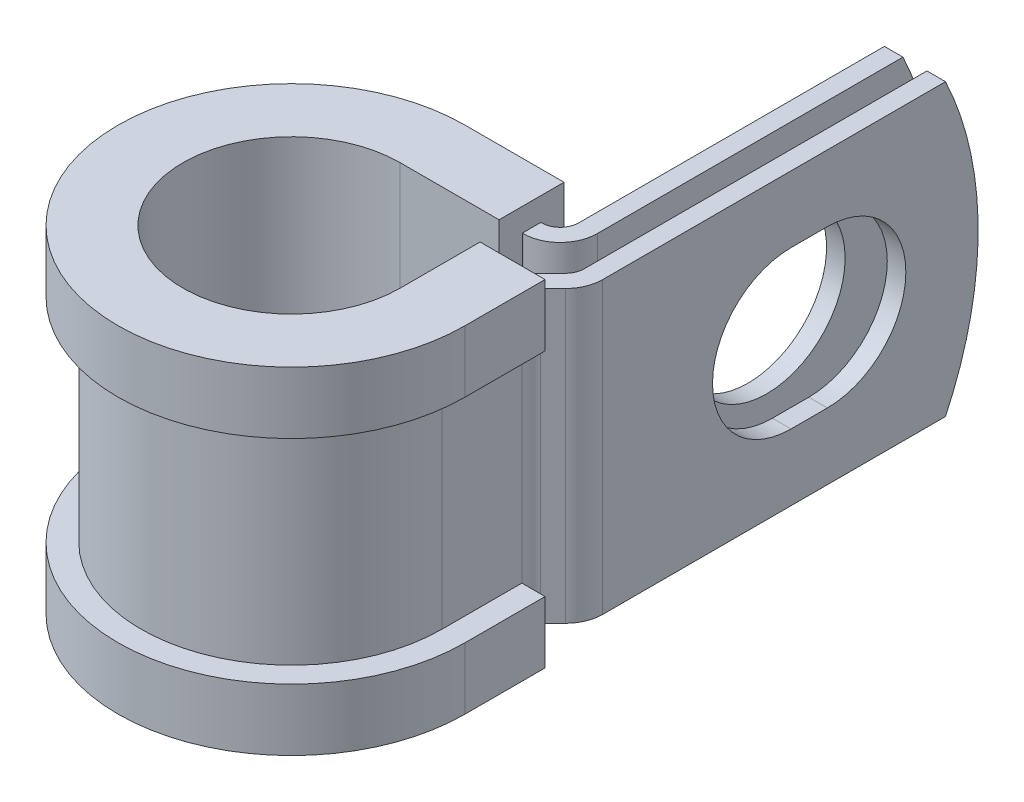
ISO-10303-21;
HEADER;
FILE_DESCRIPTION(('STEP AP214'),'2;1');
FILE_NAME('part.step','',(''),(''),'','','');
FILE_SCHEMA(('AUTOMOTIVE_DESIGN { 1 0 10303 214 1 1 1 1 }'));
ENDSEC;
DATA;
#1=APPLICATION_CONTEXT('core data for automotive mechanical design processes');
#2=APPLICATION_PROTOCOL_DEFINITION('international standard','automotive_design',2000,#1);
#3=PRODUCT_CONTEXT('',#1,'mechanical');
#4=PRODUCT('Part','Part','',(#3));
#5=PRODUCT_RELATED_PRODUCT_CATEGORY('part','',(#4));
#6=PRODUCT_DEFINITION_FORMATION('','',#4);
#7=PRODUCT_DEFINITION_CONTEXT('part definition',#1,'design');
#8=PRODUCT_DEFINITION('design','',#6,#7);
#9=PRODUCT_DEFINITION_SHAPE('','',#8);
#10=(LENGTH_UNIT() NAMED_UNIT(*) SI_UNIT(.MILLI.,.METRE.));
#11=(NAMED_UNIT(*) PLANE_ANGLE_UNIT() SI_UNIT($,.RADIAN.));
#12=(NAMED_UNIT(*) SI_UNIT($,.STERADIAN.) SOLID_ANGLE_UNIT());
#13=UNCERTAINTY_MEASURE_WITH_UNIT(LENGTH_MEASURE(1.E-05),#10,'distance_accuracy_value','');
#14=(GEOMETRIC_REPRESENTATION_CONTEXT(3) GLOBAL_UNCERTAINTY_ASSIGNED_CONTEXT((#13)) GLOBAL_UNIT_ASSIGNED_CONTEXT((#10,
#11,#12)) REPRESENTATION_CONTEXT('',''));
#15=CARTESIAN_POINT('',(0.,0.,0.));
#16=DIRECTION('',(0.,0.,1.));
#17=DIRECTION('',(1.,0.,0.));
#18=AXIS2_PLACEMENT_3D('',#15,#16,#17);
#19=CARTESIAN_POINT('',(9.33966980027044,-9.525,-8.6614));
#20=DIRECTION('',(0.,1.,0.));
#21=DIRECTION('',(1.,0.,0.));
#22=AXIS2_PLACEMENT_3D('',#19,#20,#21);
#23=PLANE('',#22);
#24=DIRECTION('',(0.,0.,-1.));
#25=VECTOR('',#24,1.);
#26=CARTESIAN_POINT('',(6.49486980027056,-9.525,-8.6614));
#27=LINE('',#26,#25);
#28=CARTESIAN_POINT('',(6.49486980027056,-9.525,-8.6614));
#29=VERTEX_POINT('',#28);
#30=CARTESIAN_POINT('',(6.49486980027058,-9.525,-9.8806));
#31=VERTEX_POINT('',#30);
#32=EDGE_CURVE('E524',#29,#31,#27,.T.);
#33=ORIENTED_EDGE('',*,*,#32,.T.);
#34=DIRECTION('',(1.,0.,0.));
#35=VECTOR('',#34,1.);
#36=CARTESIAN_POINT('',(0.,-9.525,-9.8806));
#37=LINE('',#36,#35);
#38=CARTESIAN_POINT('',(6.54566980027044,-9.525,-9.8806));
#39=VERTEX_POINT('',#38);
#40=EDGE_CURVE('E411',#39,#31,#37,.F.);
#41=ORIENTED_EDGE('',*,*,#40,.F.);
#42=CARTESIAN_POINT('',(6.54566980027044,-9.525,-11.0998));
#43=DIRECTION('',(0.,1.,0.));
#44=DIRECTION('',(1.,0.,0.));
#45=AXIS2_PLACEMENT_3D('',#42,#43,#44);
#46=CIRCLE('',#45,1.2192);
#47=CARTESIAN_POINT('',(7.76486980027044,-9.525,-11.0998));
#48=VERTEX_POINT('',#47);
#49=EDGE_CURVE('E409',#48,#39,#46,.F.);
#50=ORIENTED_EDGE('',*,*,#49,.F.);
#51=DIRECTION('',(0.,0.,1.));
#52=VECTOR('',#51,1.);
#53=CARTESIAN_POINT('',(7.76486980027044,-9.525,-33.3248));
#54=LINE('',#53,#52);
#55=CARTESIAN_POINT('',(7.76486980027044,-9.525,-31.1802631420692));
#56=VERTEX_POINT('',#55);
#57=EDGE_CURVE('E407',#56,#48,#54,.T.);
#58=ORIENTED_EDGE('',*,*,#57,.F.);
#59=DIRECTION('',(-1.,0.,0.));
#60=VECTOR('',#59,1.);
#61=CARTESIAN_POINT('',(11.7780698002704,-9.525,-31.1802631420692));
#62=LINE('',#61,#60);
#63=CARTESIAN_POINT('',(8.98406980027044,-9.525,-31.1802631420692));
#64=VERTEX_POINT('',#63);
#65=EDGE_CURVE('E12',#64,#56,#62,.T.);
#66=ORIENTED_EDGE('',*,*,#65,.F.);
#67=DIRECTION('',(0.,0.,1.));
#68=VECTOR('',#67,1.);
#69=CARTESIAN_POINT('',(8.98406980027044,-9.525,-33.3248));
#70=LINE('',#69,#68);
#71=CARTESIAN_POINT('',(8.98406980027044,-9.525,-11.0998));
#72=VERTEX_POINT('',#71);
#73=EDGE_CURVE('E405',#64,#72,#70,.T.);
#74=ORIENTED_EDGE('',*,*,#73,.T.);
#75=CARTESIAN_POINT('',(6.54566980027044,-9.525,-11.0998));
#76=DIRECTION('',(0.,-1.,0.));
#77=DIRECTION('',(0.,0.,1.));
#78=AXIS2_PLACEMENT_3D('',#75,#76,#77);
#79=CIRCLE('',#78,2.4384);
#80=CARTESIAN_POINT('',(6.54566980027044,-9.525,-8.6614));
#81=VERTEX_POINT('',#80);
#82=EDGE_CURVE('E402',#72,#81,#79,.T.);
#83=ORIENTED_EDGE('',*,*,#82,.T.);
#84=DIRECTION('',(-1.,0.,0.));
#85=VECTOR('',#84,1.);
#86=CARTESIAN_POINT('',(0.,-9.525,-8.6614));
#87=LINE('',#86,#85);
#88=EDGE_CURVE('E399',#81,#29,#87,.T.);
#89=ORIENTED_EDGE('',*,*,#88,.T.);
#90=EDGE_LOOP('',(#33,#41,#50,#58,#66,#74,#83,#89));
#91=FACE_BOUND('',#90,.T.);
#92=ADVANCED_FACE('F55',(#91),#23,.F.);
#93=CARTESIAN_POINT('',(9.33966980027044,9.525,-8.6614));
#94=DIRECTION('',(0.,1.,0.));
#95=DIRECTION('',(1.,0.,0.));
#96=AXIS2_PLACEMENT_3D('',#93,#94,#95);
#97=PLANE('',#96);
#98=DIRECTION('',(1.,0.,0.));
#99=VECTOR('',#98,1.);
#100=CARTESIAN_POINT('',(0.,9.525,-9.8806));
#101=LINE('',#100,#99);
#102=CARTESIAN_POINT('',(6.54566980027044,9.525,-9.8806));
#103=VERTEX_POINT('',#102);
#104=CARTESIAN_POINT('',(6.49486980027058,9.525,-9.8806));
#105=VERTEX_POINT('',#104);
#106=EDGE_CURVE('E369',#103,#105,#101,.F.);
#107=ORIENTED_EDGE('',*,*,#106,.T.);
#108=DIRECTION('',(0.,0.,1.));
#109=VECTOR('',#108,1.);
#110=CARTESIAN_POINT('',(6.49486980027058,9.525,-9.8806));
#111=LINE('',#110,#109);
#112=CARTESIAN_POINT('',(6.49486980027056,9.525,-8.6614));
#113=VERTEX_POINT('',#112);
#114=EDGE_CURVE('E518',#105,#113,#111,.T.);
#115=ORIENTED_EDGE('',*,*,#114,.T.);
#116=DIRECTION('',(-1.,0.,0.));
#117=VECTOR('',#116,1.);
#118=CARTESIAN_POINT('',(0.,9.525,-8.6614));
#119=LINE('',#118,#117);
#120=CARTESIAN_POINT('',(6.54566980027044,9.525,-8.6614));
#121=VERTEX_POINT('',#120);
#122=EDGE_CURVE('E626',#121,#113,#119,.T.);
#123=ORIENTED_EDGE('',*,*,#122,.F.);
#124=CARTESIAN_POINT('',(6.54566980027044,9.525,-11.0998));
#125=DIRECTION('',(0.,-1.,0.));
#126=DIRECTION('',(0.,0.,1.));
#127=AXIS2_PLACEMENT_3D('',#124,#125,#126);
#128=CIRCLE('',#127,2.4384);
#129=CARTESIAN_POINT('',(8.98406980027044,9.525,-11.0998));
#130=VERTEX_POINT('',#129);
#131=EDGE_CURVE('E371',#130,#121,#128,.T.);
#132=ORIENTED_EDGE('',*,*,#131,.F.);
#133=DIRECTION('',(0.,0.,1.));
#134=VECTOR('',#133,1.);
#135=CARTESIAN_POINT('',(8.98406980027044,9.525,-33.3248));
#136=LINE('',#135,#134);
#137=CARTESIAN_POINT('',(8.98406980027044,9.525,-31.1802631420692));
#138=VERTEX_POINT('',#137);
#139=EDGE_CURVE('E362',#138,#130,#136,.T.);
#140=ORIENTED_EDGE('',*,*,#139,.F.);
#141=DIRECTION('',(-1.,0.,0.));
#142=VECTOR('',#141,1.);
#143=CARTESIAN_POINT('',(11.7780698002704,9.525,-31.1802631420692));
#144=LINE('',#143,#142);
#145=CARTESIAN_POINT('',(7.76486980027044,9.525,-31.1802631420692));
#146=VERTEX_POINT('',#145);
#147=EDGE_CURVE('E63',#138,#146,#144,.T.);
#148=ORIENTED_EDGE('',*,*,#147,.T.);
#149=DIRECTION('',(0.,0.,1.));
#150=VECTOR('',#149,1.);
#151=CARTESIAN_POINT('',(7.76486980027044,9.525,-33.3248));
#152=LINE('',#151,#150);
#153=CARTESIAN_POINT('',(7.76486980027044,9.525,-11.0998));
#154=VERTEX_POINT('',#153);
#155=EDGE_CURVE('E359',#146,#154,#152,.T.);
#156=ORIENTED_EDGE('',*,*,#155,.T.);
#157=CARTESIAN_POINT('',(6.54566980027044,9.525,-11.0998));
#158=DIRECTION('',(0.,1.,0.));
#159=DIRECTION('',(1.,0.,0.));
#160=AXIS2_PLACEMENT_3D('',#157,#158,#159);
#161=CIRCLE('',#160,1.2192);
#162=EDGE_CURVE('E367',#154,#103,#161,.F.);
#163=ORIENTED_EDGE('',*,*,#162,.T.);
#164=EDGE_LOOP('',(#107,#115,#123,#132,#140,#148,#156,#163));
#165=FACE_BOUND('',#164,.T.);
#166=ADVANCED_FACE('F358',(#165),#97,.T.);
#167=CARTESIAN_POINT('',(0.,9.525,-8.6614));
#168=DIRECTION('',(0.,0.,1.));
#169=DIRECTION('',(1.,0.,0.));
#170=AXIS2_PLACEMENT_3D('',#167,#168,#169);
#171=PLANE('',#170);
#172=ORIENTED_EDGE('',*,*,#122,.T.);
#173=DIRECTION('',(0.,-1.,0.));
#174=VECTOR('',#173,1.);
#175=CARTESIAN_POINT('',(6.49486980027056,9.525,-8.6614));
#176=LINE('',#175,#174);
#177=EDGE_CURVE('E521',#113,#29,#176,.T.);
#178=ORIENTED_EDGE('',*,*,#177,.T.);
#179=ORIENTED_EDGE('',*,*,#88,.F.);
#180=DIRECTION('',(0.,-1.,0.));
#181=VECTOR('',#180,1.);
#182=CARTESIAN_POINT('',(6.54566980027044,9.525,-8.6614));
#183=LINE('',#182,#181);
#184=EDGE_CURVE('E345',#121,#81,#183,.T.);
#185=ORIENTED_EDGE('',*,*,#184,.F.);
#186=EDGE_LOOP('',(#172,#178,#179,#185));
#187=FACE_BOUND('',#186,.T.);
#188=ADVANCED_FACE('F636',(#187),#171,.T.);
#189=CARTESIAN_POINT('',(11.7780698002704,9.525,-8.6614));
#190=DIRECTION('',(-1.,0.,0.));
#191=DIRECTION('',(0.,0.,1.));
#192=AXIS2_PLACEMENT_3D('',#189,#190,#191);
#193=PLANE('',#192);
#194=CARTESIAN_POINT('',(11.7780698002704,0.,-23.4187999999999));
#195=DIRECTION('',(1.,0.,0.));
#196=DIRECTION('',(0.,0.,-1.));
#197=AXIS2_PLACEMENT_3D('',#194,#195,#196);
#198=CIRCLE('',#197,5.1562);
#199=CARTESIAN_POINT('',(11.7780698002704,-5.1562,-23.4188000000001));
#200=VERTEX_POINT('',#199);
#201=CARTESIAN_POINT('',(11.7780698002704,5.1562,-23.4188000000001));
#202=VERTEX_POINT('',#201);
#203=EDGE_CURVE('E581',#200,#202,#198,.T.);
#204=ORIENTED_EDGE('',*,*,#203,.F.);
#205=DIRECTION('',(0.,0.,-1.));
#206=VECTOR('',#205,1.);
#207=CARTESIAN_POINT('',(11.7780698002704,-5.1562,-21.0311999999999));
#208=LINE('',#207,#206);
#209=CARTESIAN_POINT('',(11.7780698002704,-5.1562,-21.0311999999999));
#210=VERTEX_POINT('',#209);
#211=EDGE_CURVE('E584',#210,#200,#208,.T.);
#212=ORIENTED_EDGE('',*,*,#211,.F.);
#213=CARTESIAN_POINT('',(11.7780698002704,0.,-21.0311999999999));
#214=DIRECTION('',(1.,0.,0.));
#215=DIRECTION('',(0.,0.,-1.));
#216=AXIS2_PLACEMENT_3D('',#213,#214,#215);
#217=CIRCLE('',#216,5.1562);
#218=CARTESIAN_POINT('',(11.7780698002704,5.1562,-21.0311999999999));
#219=VERTEX_POINT('',#218);
#220=EDGE_CURVE('E577',#219,#210,#217,.T.);
#221=ORIENTED_EDGE('',*,*,#220,.F.);
#222=DIRECTION('',(0.,0.,1.));
#223=VECTOR('',#222,1.);
#224=CARTESIAN_POINT('',(11.7780698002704,5.1562,-21.0311999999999));
#225=LINE('',#224,#223);
#226=EDGE_CURVE('E578',#202,#219,#225,.T.);
#227=ORIENTED_EDGE('',*,*,#226,.F.);
#228=EDGE_LOOP('',(#204,#212,#221,#227));
#229=FACE_BOUND('',#228,.T.);
#230=DIRECTION('',(0.,0.,-1.));
#231=VECTOR('',#230,1.);
#232=CARTESIAN_POINT('',(11.7780698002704,-9.525,-8.6614));
#233=LINE('',#232,#231);
#234=CARTESIAN_POINT('',(11.7780698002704,-9.525,-8.6614));
#235=VERTEX_POINT('',#234);
#236=CARTESIAN_POINT('',(11.7780698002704,-9.525,-31.1802631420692));
#237=VERTEX_POINT('',#236);
#238=EDGE_CURVE('E383',#235,#237,#233,.T.);
#239=ORIENTED_EDGE('',*,*,#238,.T.);
#240=CARTESIAN_POINT('',(11.7780698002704,0.,-11.0998));
#241=DIRECTION('',(-1.,0.,0.));
#242=DIRECTION('',(0.,0.,1.));
#243=AXIS2_PLACEMENT_3D('',#240,#241,#242);
#244=CIRCLE('',#243,22.225);
#245=CARTESIAN_POINT('',(11.7780698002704,9.525,-31.1802631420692));
#246=VERTEX_POINT('',#245);
#247=EDGE_CURVE('E569',#246,#237,#244,.T.);
#248=ORIENTED_EDGE('',*,*,#247,.F.);
#249=DIRECTION('',(0.,0.,-1.));
#250=VECTOR('',#249,1.);
#251=CARTESIAN_POINT('',(11.7780698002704,9.525,-8.6614));
#252=LINE('',#251,#250);
#253=CARTESIAN_POINT('',(11.7780698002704,9.525,-8.6614));
#254=VERTEX_POINT('',#253);
#255=EDGE_CURVE('E420',#254,#246,#252,.T.);
#256=ORIENTED_EDGE('',*,*,#255,.F.);
#257=DIRECTION('',(0.,-1.,0.));
#258=VECTOR('',#257,1.);
#259=CARTESIAN_POINT('',(11.7780698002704,9.525,-8.6614));
#260=LINE('',#259,#258);
#261=EDGE_CURVE('E382',#254,#235,#260,.T.);
#262=ORIENTED_EDGE('',*,*,#261,.T.);
#263=EDGE_LOOP('',(#239,#248,#256,#262));
#264=FACE_BOUND('',#263,.T.);
#265=ADVANCED_FACE('F57',(#229,#264),#193,.F.);
#266=CARTESIAN_POINT('',(10.5588698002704,9.525,-8.6614));
#267=DIRECTION('',(-1.,0.,0.));
#268=DIRECTION('',(0.,0.,1.));
#269=AXIS2_PLACEMENT_3D('',#266,#267,#268);
#270=PLANE('',#269);
#271=DIRECTION('',(0.,0.,-1.));
#272=VECTOR('',#271,1.);
#273=CARTESIAN_POINT('',(10.5588698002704,-5.1562,-21.0311999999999));
#274=LINE('',#273,#272);
#275=CARTESIAN_POINT('',(10.5588698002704,-5.1562,-21.0311999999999));
#276=VERTEX_POINT('',#275);
#277=CARTESIAN_POINT('',(10.5588698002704,-5.1562,-23.4188000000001));
#278=VERTEX_POINT('',#277);
#279=EDGE_CURVE('E580',#276,#278,#274,.T.);
#280=ORIENTED_EDGE('',*,*,#279,.T.);
#281=CARTESIAN_POINT('',(10.5588698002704,0.,-23.4187999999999));
#282=DIRECTION('',(-1.,0.,0.));
#283=DIRECTION('',(0.,0.,1.));
#284=AXIS2_PLACEMENT_3D('',#281,#282,#283);
#285=CIRCLE('',#284,5.1562);
#286=CARTESIAN_POINT('',(10.5588698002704,5.1562,-23.4188000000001));
#287=VERTEX_POINT('',#286);
#288=EDGE_CURVE('E601',#278,#287,#285,.F.);
#289=ORIENTED_EDGE('',*,*,#288,.T.);
#290=DIRECTION('',(0.,0.,1.));
#291=VECTOR('',#290,1.);
#292=CARTESIAN_POINT('',(10.5588698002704,5.1562,-21.0311999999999));
#293=LINE('',#292,#291);
#294=CARTESIAN_POINT('',(10.5588698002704,5.1562,-21.0311999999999));
#295=VERTEX_POINT('',#294);
#296=EDGE_CURVE('E597',#287,#295,#293,.T.);
#297=ORIENTED_EDGE('',*,*,#296,.T.);
#298=CARTESIAN_POINT('',(10.5588698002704,0.,-21.0311999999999));
#299=DIRECTION('',(-1.,0.,0.));
#300=DIRECTION('',(0.,0.,1.));
#301=AXIS2_PLACEMENT_3D('',#298,#299,#300);
#302=CIRCLE('',#301,5.1562);
#303=EDGE_CURVE('E592',#295,#276,#302,.F.);
#304=ORIENTED_EDGE('',*,*,#303,.T.);
#305=EDGE_LOOP('',(#280,#289,#297,#304));
#306=FACE_BOUND('',#305,.T.);
#307=CARTESIAN_POINT('',(10.5588698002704,0.,-11.0998));
#308=DIRECTION('',(-1.,0.,0.));
#309=DIRECTION('',(0.,0.,1.));
#310=AXIS2_PLACEMENT_3D('',#307,#308,#309);
#311=CIRCLE('',#310,22.225);
#312=CARTESIAN_POINT('',(10.5588698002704,9.525,-31.1802631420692));
#313=VERTEX_POINT('',#312);
#314=CARTESIAN_POINT('',(10.5588698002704,-9.525,-31.1802631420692));
#315=VERTEX_POINT('',#314);
#316=EDGE_CURVE('E77',#313,#315,#311,.T.);
#317=ORIENTED_EDGE('',*,*,#316,.T.);
#318=DIRECTION('',(0.,0.,-1.));
#319=VECTOR('',#318,1.);
#320=CARTESIAN_POINT('',(10.5588698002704,-9.525,-8.6614));
#321=LINE('',#320,#319);
#322=CARTESIAN_POINT('',(10.5588698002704,-9.525,-8.6614));
#323=VERTEX_POINT('',#322);
#324=EDGE_CURVE('E386',#323,#315,#321,.T.);
#325=ORIENTED_EDGE('',*,*,#324,.F.);
#326=DIRECTION('',(0.,-1.,0.));
#327=VECTOR('',#326,1.);
#328=CARTESIAN_POINT('',(10.5588698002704,9.525,-8.6614));
#329=LINE('',#328,#327);
#330=CARTESIAN_POINT('',(10.5588698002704,9.525,-8.6614));
#331=VERTEX_POINT('',#330);
#332=EDGE_CURVE('E353',#331,#323,#329,.T.);
#333=ORIENTED_EDGE('',*,*,#332,.F.);
#334=DIRECTION('',(0.,0.,-1.));
#335=VECTOR('',#334,1.);
#336=CARTESIAN_POINT('',(10.5588698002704,9.525,-8.6614));
#337=LINE('',#336,#335);
#338=EDGE_CURVE('E616',#331,#313,#337,.T.);
#339=ORIENTED_EDGE('',*,*,#338,.T.);
#340=EDGE_LOOP('',(#317,#325,#333,#339));
#341=FACE_BOUND('',#340,.T.);
#342=ADVANCED_FACE('F690',(#306,#341),#270,.T.);
#343=CARTESIAN_POINT('',(8.98406980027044,9.525,-33.3248));
#344=DIRECTION('',(1.,0.,0.));
#345=DIRECTION('',(0.,0.,-1.));
#346=AXIS2_PLACEMENT_3D('',#343,#344,#345);
#347=PLANE('',#346);
#348=CARTESIAN_POINT('',(8.98406980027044,0.,-22.225));
#349=DIRECTION('',(1.,0.,0.));
#350=DIRECTION('',(0.,0.,-1.));
#351=AXIS2_PLACEMENT_3D('',#348,#349,#350);
#352=CIRCLE('',#351,5.1562);
#353=CARTESIAN_POINT('',(8.98406980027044,0.,-27.3812));
#354=VERTEX_POINT('',#353);
#355=EDGE_CURVE('E387',#354,#354,#352,.F.);
#356=ORIENTED_EDGE('',*,*,#355,.T.);
#357=EDGE_LOOP('',(#356));
#358=FACE_BOUND('',#357,.T.);
#359=ORIENTED_EDGE('',*,*,#73,.F.);
#360=CARTESIAN_POINT('',(8.98406980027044,0.,-11.0998));
#361=DIRECTION('',(1.,0.,0.));
#362=DIRECTION('',(0.,0.,-1.));
#363=AXIS2_PLACEMENT_3D('',#360,#361,#362);
#364=CIRCLE('',#363,22.225);
#365=EDGE_CURVE('E574',#64,#138,#364,.T.);
#366=ORIENTED_EDGE('',*,*,#365,.T.);
#367=ORIENTED_EDGE('',*,*,#139,.T.);
#368=DIRECTION('',(0.,-1.,0.));
#369=VECTOR('',#368,1.);
#370=CARTESIAN_POINT('',(8.98406980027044,9.525,-11.0998));
#371=LINE('',#370,#369);
#372=EDGE_CURVE('E342',#130,#72,#371,.T.);
#373=ORIENTED_EDGE('',*,*,#372,.T.);
#374=EDGE_LOOP('',(#359,#366,#367,#373));
#375=FACE_BOUND('',#374,.T.);
#376=ADVANCED_FACE('F642',(#358,#375),#347,.T.);
#377=CARTESIAN_POINT('',(7.76486980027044,9.525,-33.3248));
#378=DIRECTION('',(1.,0.,0.));
#379=DIRECTION('',(0.,0.,-1.));
#380=AXIS2_PLACEMENT_3D('',#377,#378,#379);
#381=PLANE('',#380);
#382=CARTESIAN_POINT('',(7.76486980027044,0.,-22.225));
#383=DIRECTION('',(-1.,0.,0.));
#384=DIRECTION('',(0.,0.,1.));
#385=AXIS2_PLACEMENT_3D('',#382,#383,#384);
#386=CIRCLE('',#385,5.1562);
#387=CARTESIAN_POINT('',(7.76486980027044,0.,-17.0688));
#388=VERTEX_POINT('',#387);
#389=EDGE_CURVE('E609',#388,#388,#386,.T.);
#390=ORIENTED_EDGE('',*,*,#389,.F.);
#391=EDGE_LOOP('',(#390));
#392=FACE_BOUND('',#391,.T.);
#393=CARTESIAN_POINT('',(7.76486980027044,0.,-11.0998));
#394=DIRECTION('',(-1.,0.,0.));
#395=DIRECTION('',(0.,0.,1.));
#396=AXIS2_PLACEMENT_3D('',#393,#394,#395);
#397=CIRCLE('',#396,22.225);
#398=EDGE_CURVE('E69',#146,#56,#397,.T.);
#399=ORIENTED_EDGE('',*,*,#398,.T.);
#400=ORIENTED_EDGE('',*,*,#57,.T.);
#401=DIRECTION('',(0.,-1.,0.));
#402=VECTOR('',#401,1.);
#403=CARTESIAN_POINT('',(7.76486980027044,9.525,-11.0998));
#404=LINE('',#403,#402);
#405=EDGE_CURVE('E339',#154,#48,#404,.T.);
#406=ORIENTED_EDGE('',*,*,#405,.F.);
#407=ORIENTED_EDGE('',*,*,#155,.F.);
#408=EDGE_LOOP('',(#399,#400,#406,#407));
#409=FACE_BOUND('',#408,.T.);
#410=ADVANCED_FACE('F365',(#392,#409),#381,.F.);
#411=CARTESIAN_POINT('',(11.0998,-9.525,-5.24890267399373));
#412=DIRECTION('',(0.,1.,0.));
#413=DIRECTION('',(1.,0.,0.));
#414=AXIS2_PLACEMENT_3D('',#411,#412,#413);
#415=CIRCLE('',#414,1.2192);
#416=CARTESIAN_POINT('',(9.8806,-9.525,-5.24890267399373));
#417=VERTEX_POINT('',#416);
#418=CARTESIAN_POINT('',(10.2376954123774,-9.525,-6.11100726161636));
#419=VERTEX_POINT('',#418);
#420=EDGE_CURVE('E414',#417,#419,#415,.F.);
#421=ORIENTED_EDGE('',*,*,#420,.F.);
#422=DIRECTION('',(1.,0.,0.));
#423=VECTOR('',#422,1.);
#424=CARTESIAN_POINT('',(8.6614,-9.525,-5.24890267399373));
#425=LINE('',#424,#423);
#426=CARTESIAN_POINT('',(8.6614,-9.525,-5.24890267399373));
#427=VERTEX_POINT('',#426);
#428=EDGE_CURVE('E452',#427,#417,#425,.T.);
#429=ORIENTED_EDGE('',*,*,#428,.F.);
#430=CARTESIAN_POINT('',(11.0998,-9.525,-5.24890267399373));
#431=DIRECTION('',(0.,-1.,0.));
#432=DIRECTION('',(0.,0.,1.));
#433=AXIS2_PLACEMENT_3D('',#430,#431,#432);
#434=CIRCLE('',#433,2.4384);
#435=CARTESIAN_POINT('',(9.37559082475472,-9.525,-6.973111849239));
#436=VERTEX_POINT('',#435);
#437=EDGE_CURVE('E396',#427,#436,#434,.T.);
#438=ORIENTED_EDGE('',*,*,#437,.T.);
#439=DIRECTION('',(0.707106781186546,0.,-0.707106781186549));
#440=VECTOR('',#439,1.);
#441=CARTESIAN_POINT('',(9.37559082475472,-9.525,-6.973111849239));
#442=LINE('',#441,#440);
#443=CARTESIAN_POINT('',(10.2017743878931,-9.525,-7.79929541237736));
#444=VERTEX_POINT('',#443);
#445=EDGE_CURVE('E393',#436,#444,#442,.T.);
#446=ORIENTED_EDGE('',*,*,#445,.T.);
#447=CARTESIAN_POINT('',(9.33966980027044,-9.525,-8.6614));
#448=DIRECTION('',(0.,1.,0.));
#449=DIRECTION('',(0.,0.,1.));
#450=AXIS2_PLACEMENT_3D('',#447,#448,#449);
#451=CIRCLE('',#450,1.2192);
#452=EDGE_CURVE('E390',#444,#323,#451,.T.);
#453=ORIENTED_EDGE('',*,*,#452,.T.);
#454=ORIENTED_EDGE('',*,*,#324,.T.);
#455=DIRECTION('',(-1.,0.,0.));
#456=VECTOR('',#455,1.);
#457=CARTESIAN_POINT('',(11.7780698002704,-9.525,-31.1802631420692));
#458=LINE('',#457,#456);
#459=EDGE_CURVE('E567',#237,#315,#458,.T.);
#460=ORIENTED_EDGE('',*,*,#459,.F.);
#461=ORIENTED_EDGE('',*,*,#238,.F.);
#462=CARTESIAN_POINT('',(9.33966980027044,-9.525,-8.6614));
#463=DIRECTION('',(0.,1.,0.));
#464=DIRECTION('',(1.,0.,0.));
#465=AXIS2_PLACEMENT_3D('',#462,#463,#464);
#466=CIRCLE('',#465,2.4384);
#467=CARTESIAN_POINT('',(11.0638789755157,-9.525,-6.93719082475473));
#468=VERTEX_POINT('',#467);
#469=EDGE_CURVE('E418',#468,#235,#466,.T.);
#470=ORIENTED_EDGE('',*,*,#469,.F.);
#471=DIRECTION('',(0.707106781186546,0.,-0.707106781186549));
#472=VECTOR('',#471,1.);
#473=CARTESIAN_POINT('',(10.2376954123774,-9.525,-6.11100726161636));
#474=LINE('',#473,#472);
#475=EDGE_CURVE('E416',#419,#468,#474,.T.);
#476=ORIENTED_EDGE('',*,*,#475,.F.);
#477=EDGE_LOOP('',(#421,#429,#438,#446,#453,#454,#460,#461,#470,#476));
#478=FACE_BOUND('',#477,.T.);
#479=ADVANCED_FACE('F676',(#478),#23,.F.);
#480=DIRECTION('',(-1.,0.,0.));
#481=VECTOR('',#480,1.);
#482=CARTESIAN_POINT('',(9.8806,9.525,-5.24890267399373));
#483=LINE('',#482,#481);
#484=CARTESIAN_POINT('',(9.8806,9.525,-5.24890267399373));
#485=VERTEX_POINT('',#484);
#486=CARTESIAN_POINT('',(8.6614,9.525,-5.24890267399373));
#487=VERTEX_POINT('',#486);
#488=EDGE_CURVE('E441',#485,#487,#483,.T.);
#489=ORIENTED_EDGE('',*,*,#488,.F.);
#490=CARTESIAN_POINT('',(11.0998,9.525,-5.24890267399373));
#491=DIRECTION('',(0.,1.,0.));
#492=DIRECTION('',(1.,0.,0.));
#493=AXIS2_PLACEMENT_3D('',#490,#491,#492);
#494=CIRCLE('',#493,1.2192);
#495=CARTESIAN_POINT('',(10.2376954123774,9.525,-6.11100726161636));
#496=VERTEX_POINT('',#495);
#497=EDGE_CURVE('E376',#485,#496,#494,.F.);
#498=ORIENTED_EDGE('',*,*,#497,.T.);
#499=DIRECTION('',(0.707106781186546,0.,-0.707106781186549));
#500=VECTOR('',#499,1.);
#501=CARTESIAN_POINT('',(10.2376954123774,9.525,-6.11100726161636));
#502=LINE('',#501,#500);
#503=CARTESIAN_POINT('',(11.0638789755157,9.525,-6.93719082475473));
#504=VERTEX_POINT('',#503);
#505=EDGE_CURVE('E378',#496,#504,#502,.T.);
#506=ORIENTED_EDGE('',*,*,#505,.T.);
#507=CARTESIAN_POINT('',(9.33966980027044,9.525,-8.6614));
#508=DIRECTION('',(0.,1.,0.));
#509=DIRECTION('',(1.,0.,0.));
#510=AXIS2_PLACEMENT_3D('',#507,#508,#509);
#511=CIRCLE('',#510,2.4384);
#512=EDGE_CURVE('E380',#504,#254,#511,.T.);
#513=ORIENTED_EDGE('',*,*,#512,.T.);
#514=ORIENTED_EDGE('',*,*,#255,.T.);
#515=DIRECTION('',(-1.,0.,0.));
#516=VECTOR('',#515,1.);
#517=CARTESIAN_POINT('',(11.7780698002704,9.525,-31.1802631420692));
#518=LINE('',#517,#516);
#519=EDGE_CURVE('E571',#246,#313,#518,.T.);
#520=ORIENTED_EDGE('',*,*,#519,.T.);
#521=ORIENTED_EDGE('',*,*,#338,.F.);
#522=CARTESIAN_POINT('',(9.33966980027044,9.525,-8.6614));
#523=DIRECTION('',(0.,1.,0.));
#524=DIRECTION('',(0.,0.,1.));
#525=AXIS2_PLACEMENT_3D('',#522,#523,#524);
#526=CIRCLE('',#525,1.2192);
#527=CARTESIAN_POINT('',(10.2017743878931,9.525,-7.79929541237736));
#528=VERTEX_POINT('',#527);
#529=EDGE_CURVE('E619',#528,#331,#526,.T.);
#530=ORIENTED_EDGE('',*,*,#529,.F.);
#531=DIRECTION('',(0.707106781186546,0.,-0.707106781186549));
#532=VECTOR('',#531,1.);
#533=CARTESIAN_POINT('',(9.37559082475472,9.525,-6.973111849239));
#534=LINE('',#533,#532);
#535=CARTESIAN_POINT('',(9.37559082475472,9.525,-6.973111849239));
#536=VERTEX_POINT('',#535);
#537=EDGE_CURVE('E622',#536,#528,#534,.T.);
#538=ORIENTED_EDGE('',*,*,#537,.F.);
#539=CARTESIAN_POINT('',(11.0998,9.525,-5.24890267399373));
#540=DIRECTION('',(0.,-1.,0.));
#541=DIRECTION('',(0.,0.,1.));
#542=AXIS2_PLACEMENT_3D('',#539,#540,#541);
#543=CIRCLE('',#542,2.4384);
#544=EDGE_CURVE('E451',#487,#536,#543,.T.);
#545=ORIENTED_EDGE('',*,*,#544,.F.);
#546=EDGE_LOOP('',(#489,#498,#506,#513,#514,#520,#521,#530,#538,#545));
#547=FACE_BOUND('',#546,.T.);
#548=ADVANCED_FACE('F448',(#547),#97,.T.);
#549=CARTESIAN_POINT('',(9.33966980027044,9.525,-8.6614));
#550=DIRECTION('',(0.,-1.,0.));
#551=DIRECTION('',(0.,0.,-1.));
#552=AXIS2_PLACEMENT_3D('',#549,#550,#551);
#553=CYLINDRICAL_SURFACE('',#552,1.2192);
#554=ORIENTED_EDGE('',*,*,#452,.F.);
#555=DIRECTION('',(0.,-1.,0.));
#556=VECTOR('',#555,1.);
#557=CARTESIAN_POINT('',(10.2017743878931,9.525,-7.79929541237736));
#558=LINE('',#557,#556);
#559=EDGE_CURVE('E351',#528,#444,#558,.T.);
#560=ORIENTED_EDGE('',*,*,#559,.F.);
#561=ORIENTED_EDGE('',*,*,#529,.T.);
#562=ORIENTED_EDGE('',*,*,#332,.T.);
#563=EDGE_LOOP('',(#554,#560,#561,#562));
#564=FACE_BOUND('',#563,.T.);
#565=ADVANCED_FACE('F686',(#564),#553,.F.);
#566=CARTESIAN_POINT('',(9.37559082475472,9.525,-6.973111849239));
#567=DIRECTION('',(-0.707106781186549,0.,-0.707106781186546));
#568=DIRECTION('',(-0.707106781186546,0.,0.707106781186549));
#569=AXIS2_PLACEMENT_3D('',#566,#567,#568);
#570=PLANE('',#569);
#571=ORIENTED_EDGE('',*,*,#445,.F.);
#572=DIRECTION('',(0.,-1.,0.));
#573=VECTOR('',#572,1.);
#574=CARTESIAN_POINT('',(9.37559082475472,9.525,-6.973111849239));
#575=LINE('',#574,#573);
#576=EDGE_CURVE('E349',#536,#436,#575,.T.);
#577=ORIENTED_EDGE('',*,*,#576,.F.);
#578=ORIENTED_EDGE('',*,*,#537,.T.);
#579=ORIENTED_EDGE('',*,*,#559,.T.);
#580=EDGE_LOOP('',(#571,#577,#578,#579));
#581=FACE_BOUND('',#580,.T.);
#582=ADVANCED_FACE('F681',(#581),#570,.T.);
#583=CARTESIAN_POINT('',(11.0998,9.525,-5.24890267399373));
#584=DIRECTION('',(0.,-1.,0.));
#585=DIRECTION('',(0.,0.,-1.));
#586=AXIS2_PLACEMENT_3D('',#583,#584,#585);
#587=CYLINDRICAL_SURFACE('',#586,2.4384);
#588=ORIENTED_EDGE('',*,*,#437,.F.);
#589=DIRECTION('',(0.,-1.,0.));
#590=VECTOR('',#589,1.);
#591=CARTESIAN_POINT('',(8.6614,9.525,-5.24890267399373));
#592=LINE('',#591,#590);
#593=EDGE_CURVE('E347',#487,#427,#592,.T.);
#594=ORIENTED_EDGE('',*,*,#593,.F.);
#595=ORIENTED_EDGE('',*,*,#544,.T.);
#596=ORIENTED_EDGE('',*,*,#576,.T.);
#597=EDGE_LOOP('',(#588,#594,#595,#596));
#598=FACE_BOUND('',#597,.T.);
#599=ADVANCED_FACE('F678',(#598),#587,.T.);
#600=CARTESIAN_POINT('',(6.54566980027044,9.525,-11.0998));
#601=DIRECTION('',(0.,-1.,0.));
#602=DIRECTION('',(0.,0.,-1.));
#603=AXIS2_PLACEMENT_3D('',#600,#601,#602);
#604=CYLINDRICAL_SURFACE('',#603,2.4384);
#605=ORIENTED_EDGE('',*,*,#82,.F.);
#606=ORIENTED_EDGE('',*,*,#372,.F.);
#607=ORIENTED_EDGE('',*,*,#131,.T.);
#608=ORIENTED_EDGE('',*,*,#184,.T.);
#609=EDGE_LOOP('',(#605,#606,#607,#608));
#610=FACE_BOUND('',#609,.T.);
#611=ADVANCED_FACE('F632',(#610),#604,.T.);
#612=CARTESIAN_POINT('',(6.54566980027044,9.525,-11.0998));
#613=DIRECTION('',(0.,-1.,0.));
#614=DIRECTION('',(0.,0.,-1.));
#615=AXIS2_PLACEMENT_3D('',#612,#613,#614);
#616=CYLINDRICAL_SURFACE('',#615,1.2192);
#617=ORIENTED_EDGE('',*,*,#49,.T.);
#618=DIRECTION('',(0.,-1.,0.));
#619=VECTOR('',#618,1.);
#620=CARTESIAN_POINT('',(6.54566980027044,9.525,-9.8806));
#621=LINE('',#620,#619);
#622=EDGE_CURVE('E330',#103,#39,#621,.T.);
#623=ORIENTED_EDGE('',*,*,#622,.F.);
#624=ORIENTED_EDGE('',*,*,#162,.F.);
#625=ORIENTED_EDGE('',*,*,#405,.T.);
#626=EDGE_LOOP('',(#617,#623,#624,#625));
#627=FACE_BOUND('',#626,.T.);
#628=ADVANCED_FACE('F647',(#627),#616,.F.);
#629=CARTESIAN_POINT('',(0.,9.525,-9.8806));
#630=DIRECTION('',(0.,0.,1.));
#631=DIRECTION('',(1.,0.,0.));
#632=AXIS2_PLACEMENT_3D('',#629,#630,#631);
#633=PLANE('',#632);
#634=DIRECTION('',(0.,-1.,0.));
#635=VECTOR('',#634,1.);
#636=CARTESIAN_POINT('',(0.,9.525,-9.8806));
#637=LINE('',#636,#635);
#638=CARTESIAN_POINT('',(1.38596734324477E-13,6.985,-9.8806));
#639=VERTEX_POINT('',#638);
#640=CARTESIAN_POINT('',(1.38596734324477E-13,-6.985,-9.8806));
#641=VERTEX_POINT('',#640);
#642=EDGE_CURVE('E321',#639,#641,#637,.T.);
#643=ORIENTED_EDGE('',*,*,#642,.F.);
#644=DIRECTION('',(1.,0.,0.));
#645=VECTOR('',#644,1.);
#646=CARTESIAN_POINT('',(1.38596734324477E-13,6.985,-9.8806));
#647=LINE('',#646,#645);
#648=CARTESIAN_POINT('',(6.49486980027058,6.985,-9.8806));
#649=VERTEX_POINT('',#648);
#650=EDGE_CURVE('E564',#639,#649,#647,.T.);
#651=ORIENTED_EDGE('',*,*,#650,.T.);
#652=DIRECTION('',(0.,1.,0.));
#653=VECTOR('',#652,1.);
#654=CARTESIAN_POINT('',(6.49486980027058,9.525,-9.8806));
#655=LINE('',#654,#653);
#656=EDGE_CURVE('E515',#649,#105,#655,.T.);
#657=ORIENTED_EDGE('',*,*,#656,.T.);
#658=ORIENTED_EDGE('',*,*,#106,.F.);
#659=ORIENTED_EDGE('',*,*,#622,.T.);
#660=ORIENTED_EDGE('',*,*,#40,.T.);
#661=DIRECTION('',(0.,1.,0.));
#662=VECTOR('',#661,1.);
#663=CARTESIAN_POINT('',(6.49486980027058,-9.525,-9.8806));
#664=LINE('',#663,#662);
#665=CARTESIAN_POINT('',(6.49486980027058,-6.985,-9.8806));
#666=VERTEX_POINT('',#665);
#667=EDGE_CURVE('E527',#31,#666,#664,.T.);
#668=ORIENTED_EDGE('',*,*,#667,.T.);
#669=DIRECTION('',(1.,0.,0.));
#670=VECTOR('',#669,1.);
#671=CARTESIAN_POINT('',(1.38596734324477E-13,-6.985,-9.8806));
#672=LINE('',#671,#670);
#673=EDGE_CURVE('E544',#641,#666,#672,.T.);
#674=ORIENTED_EDGE('',*,*,#673,.F.);
#675=EDGE_LOOP('',(#643,#651,#657,#658,#659,#660,#668,#674));
#676=FACE_BOUND('',#675,.T.);
#677=ADVANCED_FACE('F651',(#676),#633,.F.);
#678=CARTESIAN_POINT('',(0.,9.525,0.));
#679=DIRECTION('',(0.,-1.,0.));
#680=DIRECTION('',(0.,0.,-1.));
#681=AXIS2_PLACEMENT_3D('',#678,#679,#680);
#682=CYLINDRICAL_SURFACE('',#681,9.8806);
#683=DIRECTION('',(0.,-1.,0.));
#684=VECTOR('',#683,1.);
#685=CARTESIAN_POINT('',(9.8806,9.525,0.));
#686=LINE('',#685,#684);
#687=CARTESIAN_POINT('',(9.8806,6.985,0.));
#688=VERTEX_POINT('',#687);
#689=CARTESIAN_POINT('',(9.8806,-6.985,0.));
#690=VERTEX_POINT('',#689);
#691=EDGE_CURVE('E319',#688,#690,#686,.T.);
#692=ORIENTED_EDGE('',*,*,#691,.F.);
#693=CARTESIAN_POINT('',(0.,6.985,0.));
#694=DIRECTION('',(0.,-1.,0.));
#695=DIRECTION('',(0.,0.,-1.));
#696=AXIS2_PLACEMENT_3D('',#693,#694,#695);
#697=CIRCLE('',#696,9.8806);
#698=EDGE_CURVE('E513',#688,#639,#697,.T.);
#699=ORIENTED_EDGE('',*,*,#698,.T.);
#700=ORIENTED_EDGE('',*,*,#642,.T.);
#701=CARTESIAN_POINT('',(0.,-6.985,0.));
#702=DIRECTION('',(0.,-1.,0.));
#703=DIRECTION('',(0.,0.,-1.));
#704=AXIS2_PLACEMENT_3D('',#701,#702,#703);
#705=CIRCLE('',#704,9.8806);
#706=EDGE_CURVE('E302',#690,#641,#705,.T.);
#707=ORIENTED_EDGE('',*,*,#706,.F.);
#708=EDGE_LOOP('',(#692,#699,#700,#707));
#709=FACE_BOUND('',#708,.T.);
#710=ADVANCED_FACE('F317',(#709),#682,.T.);
#711=CARTESIAN_POINT('',(9.8806,9.525,0.));
#712=DIRECTION('',(-1.,0.,0.));
#713=DIRECTION('',(0.,0.,1.));
#714=AXIS2_PLACEMENT_3D('',#711,#712,#713);
#715=PLANE('',#714);
#716=DIRECTION('',(0.,-1.,0.));
#717=VECTOR('',#716,1.);
#718=CARTESIAN_POINT('',(9.8806,9.525,-5.24890267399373));
#719=LINE('',#718,#717);
#720=CARTESIAN_POINT('',(9.8806,6.985,-5.24890267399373));
#721=VERTEX_POINT('',#720);
#722=CARTESIAN_POINT('',(9.8806,-6.985,-5.24890267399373));
#723=VERTEX_POINT('',#722);
#724=EDGE_CURVE('E333',#721,#723,#719,.T.);
#725=ORIENTED_EDGE('',*,*,#724,.F.);
#726=DIRECTION('',(0.,0.,-1.));
#727=VECTOR('',#726,1.);
#728=CARTESIAN_POINT('',(9.8806,6.985,0.));
#729=LINE('',#728,#727);
#730=EDGE_CURVE('E327',#688,#721,#729,.T.);
#731=ORIENTED_EDGE('',*,*,#730,.F.);
#732=ORIENTED_EDGE('',*,*,#691,.T.);
#733=DIRECTION('',(0.,0.,-1.));
#734=VECTOR('',#733,1.);
#735=CARTESIAN_POINT('',(9.8806,-6.985,0.));
#736=LINE('',#735,#734);
#737=EDGE_CURVE('E298',#690,#723,#736,.T.);
#738=ORIENTED_EDGE('',*,*,#737,.T.);
#739=EDGE_LOOP('',(#725,#731,#732,#738));
#740=FACE_BOUND('',#739,.T.);
#741=ADVANCED_FACE('F326',(#740),#715,.F.);
#742=CARTESIAN_POINT('',(11.0998,9.525,-5.24890267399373));
#743=DIRECTION('',(0.,-1.,0.));
#744=DIRECTION('',(0.,0.,-1.));
#745=AXIS2_PLACEMENT_3D('',#742,#743,#744);
#746=CYLINDRICAL_SURFACE('',#745,1.2192);
#747=ORIENTED_EDGE('',*,*,#420,.T.);
#748=DIRECTION('',(0.,-1.,0.));
#749=VECTOR('',#748,1.);
#750=CARTESIAN_POINT('',(10.2376954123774,9.525,-6.11100726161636));
#751=LINE('',#750,#749);
#752=EDGE_CURVE('E425',#496,#419,#751,.T.);
#753=ORIENTED_EDGE('',*,*,#752,.F.);
#754=ORIENTED_EDGE('',*,*,#497,.F.);
#755=EDGE_CURVE('E328',#485,#721,#719,.T.);
#756=ORIENTED_EDGE('',*,*,#755,.T.);
#757=ORIENTED_EDGE('',*,*,#724,.T.);
#758=DIRECTION('',(0.,1.,0.));
#759=VECTOR('',#758,1.);
#760=CARTESIAN_POINT('',(9.8806,-9.525,-5.24890267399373));
#761=LINE('',#760,#759);
#762=EDGE_CURVE('E434',#417,#723,#761,.T.);
#763=ORIENTED_EDGE('',*,*,#762,.F.);
#764=EDGE_LOOP('',(#747,#753,#754,#756,#757,#763));
#765=FACE_BOUND('',#764,.T.);
#766=ADVANCED_FACE('F433',(#765),#746,.F.);
#767=CARTESIAN_POINT('',(10.2376954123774,9.525,-6.11100726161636));
#768=DIRECTION('',(-0.707106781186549,0.,-0.707106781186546));
#769=DIRECTION('',(-0.707106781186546,0.,0.707106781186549));
#770=AXIS2_PLACEMENT_3D('',#767,#768,#769);
#771=PLANE('',#770);
#772=ORIENTED_EDGE('',*,*,#475,.T.);
#773=DIRECTION('',(0.,-1.,0.));
#774=VECTOR('',#773,1.);
#775=CARTESIAN_POINT('',(11.0638789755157,9.525,-6.93719082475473));
#776=LINE('',#775,#774);
#777=EDGE_CURVE('E423',#504,#468,#776,.T.);
#778=ORIENTED_EDGE('',*,*,#777,.F.);
#779=ORIENTED_EDGE('',*,*,#505,.F.);
#780=ORIENTED_EDGE('',*,*,#752,.T.);
#781=EDGE_LOOP('',(#772,#778,#779,#780));
#782=FACE_BOUND('',#781,.T.);
#783=ADVANCED_FACE('F702',(#782),#771,.F.);
#784=CARTESIAN_POINT('',(9.33966980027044,9.525,-8.6614));
#785=DIRECTION('',(0.,-1.,0.));
#786=DIRECTION('',(0.,0.,-1.));
#787=AXIS2_PLACEMENT_3D('',#784,#785,#786);
#788=CYLINDRICAL_SURFACE('',#787,2.4384);
#789=ORIENTED_EDGE('',*,*,#469,.T.);
#790=ORIENTED_EDGE('',*,*,#261,.F.);
#791=ORIENTED_EDGE('',*,*,#512,.F.);
#792=ORIENTED_EDGE('',*,*,#777,.T.);
#793=EDGE_LOOP('',(#789,#790,#791,#792));
#794=FACE_BOUND('',#793,.T.);
#795=ADVANCED_FACE('F700',(#794),#788,.T.);
#796=CARTESIAN_POINT('',(23.5680057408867,0.,-22.225));
#797=DIRECTION('',(-1.,0.,0.));
#798=DIRECTION('',(0.,0.,1.));
#799=AXIS2_PLACEMENT_3D('',#796,#797,#798);
#800=CYLINDRICAL_SURFACE('',#799,5.1562);
#801=ORIENTED_EDGE('',*,*,#389,.T.);
#802=EDGE_LOOP('',(#801));
#803=FACE_BOUND('',#802,.T.);
#804=ORIENTED_EDGE('',*,*,#355,.F.);
#805=EDGE_LOOP('',(#804));
#806=FACE_BOUND('',#805,.T.);
#807=ADVANCED_FACE('F709',(#803,#806),#800,.F.);
#808=CARTESIAN_POINT('',(-5.80070213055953,-5.1562,-21.0311999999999));
#809=DIRECTION('',(0.,-1.,0.));
#810=DIRECTION('',(0.,0.,-1.));
#811=AXIS2_PLACEMENT_3D('',#808,#809,#810);
#812=PLANE('',#811);
#813=DIRECTION('',(1.,0.,0.));
#814=VECTOR('',#813,1.);
#815=CARTESIAN_POINT('',(-5.80070213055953,-5.1562,-21.0311999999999));
#816=LINE('',#815,#814);
#817=EDGE_CURVE('E595',#276,#210,#816,.T.);
#818=ORIENTED_EDGE('',*,*,#817,.T.);
#819=ORIENTED_EDGE('',*,*,#211,.T.);
#820=DIRECTION('',(1.,0.,0.));
#821=VECTOR('',#820,1.);
#822=CARTESIAN_POINT('',(-5.80070213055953,-5.1562,-23.4188000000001));
#823=LINE('',#822,#821);
#824=EDGE_CURVE('E591',#278,#200,#823,.T.);
#825=ORIENTED_EDGE('',*,*,#824,.F.);
#826=ORIENTED_EDGE('',*,*,#279,.F.);
#827=EDGE_LOOP('',(#818,#819,#825,#826));
#828=FACE_BOUND('',#827,.T.);
#829=ADVANCED_FACE('F752',(#828),#812,.F.);
#830=CARTESIAN_POINT('',(-5.80070213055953,0.,-23.4187999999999));
#831=DIRECTION('',(1.,0.,0.));
#832=DIRECTION('',(0.,0.,-1.));
#833=AXIS2_PLACEMENT_3D('',#830,#831,#832);
#834=CYLINDRICAL_SURFACE('',#833,5.1562);
#835=ORIENTED_EDGE('',*,*,#824,.T.);
#836=ORIENTED_EDGE('',*,*,#203,.T.);
#837=DIRECTION('',(1.,0.,0.));
#838=VECTOR('',#837,1.);
#839=CARTESIAN_POINT('',(-5.80070213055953,5.1562,-23.4188000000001));
#840=LINE('',#839,#838);
#841=EDGE_CURVE('E600',#287,#202,#840,.T.);
#842=ORIENTED_EDGE('',*,*,#841,.F.);
#843=ORIENTED_EDGE('',*,*,#288,.F.);
#844=EDGE_LOOP('',(#835,#836,#842,#843));
#845=FACE_BOUND('',#844,.T.);
#846=ADVANCED_FACE('F756',(#845),#834,.F.);
#847=CARTESIAN_POINT('',(-5.80070213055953,5.1562,-21.0311999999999));
#848=DIRECTION('',(0.,1.,0.));
#849=DIRECTION('',(0.,0.,1.));
#850=AXIS2_PLACEMENT_3D('',#847,#848,#849);
#851=PLANE('',#850);
#852=ORIENTED_EDGE('',*,*,#841,.T.);
#853=ORIENTED_EDGE('',*,*,#226,.T.);
#854=DIRECTION('',(1.,0.,0.));
#855=VECTOR('',#854,1.);
#856=CARTESIAN_POINT('',(-5.80070213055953,5.1562,-21.0311999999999));
#857=LINE('',#856,#855);
#858=EDGE_CURVE('E596',#295,#219,#857,.T.);
#859=ORIENTED_EDGE('',*,*,#858,.F.);
#860=ORIENTED_EDGE('',*,*,#296,.F.);
#861=EDGE_LOOP('',(#852,#853,#859,#860));
#862=FACE_BOUND('',#861,.T.);
#863=ADVANCED_FACE('F760',(#862),#851,.F.);
#864=CARTESIAN_POINT('',(-5.80070213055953,0.,-21.0311999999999));
#865=DIRECTION('',(1.,0.,0.));
#866=DIRECTION('',(0.,0.,-1.));
#867=AXIS2_PLACEMENT_3D('',#864,#865,#866);
#868=CYLINDRICAL_SURFACE('',#867,5.1562);
#869=ORIENTED_EDGE('',*,*,#858,.T.);
#870=ORIENTED_EDGE('',*,*,#220,.T.);
#871=ORIENTED_EDGE('',*,*,#817,.F.);
#872=ORIENTED_EDGE('',*,*,#303,.F.);
#873=EDGE_LOOP('',(#869,#870,#871,#872));
#874=FACE_BOUND('',#873,.T.);
#875=ADVANCED_FACE('F764',(#874),#868,.F.);
#876=CARTESIAN_POINT('',(11.7780698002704,0.,-11.0998));
#877=DIRECTION('',(-1.,0.,0.));
#878=DIRECTION('',(0.,0.,1.));
#879=AXIS2_PLACEMENT_3D('',#876,#877,#878);
#880=CYLINDRICAL_SURFACE('',#879,22.225);
#881=ORIENTED_EDGE('',*,*,#365,.F.);
#882=ORIENTED_EDGE('',*,*,#65,.T.);
#883=ORIENTED_EDGE('',*,*,#398,.F.);
#884=ORIENTED_EDGE('',*,*,#147,.F.);
#885=EDGE_LOOP('',(#881,#882,#883,#884));
#886=FACE_BOUND('',#885,.T.);
#887=ADVANCED_FACE('F643',(#886),#880,.T.);
#888=ORIENTED_EDGE('',*,*,#519,.F.);
#889=ORIENTED_EDGE('',*,*,#247,.T.);
#890=ORIENTED_EDGE('',*,*,#459,.T.);
#891=ORIENTED_EDGE('',*,*,#316,.F.);
#892=EDGE_LOOP('',(#888,#889,#890,#891));
#893=FACE_BOUND('',#892,.T.);
#894=ADVANCED_FACE('F691',(#893),#880,.T.);
#895=CARTESIAN_POINT('',(1.59974122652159E-13,11.049,-11.4046));
#896=DIRECTION('',(0.,0.,1.));
#897=DIRECTION('',(1.,0.,0.));
#898=AXIS2_PLACEMENT_3D('',#895,#896,#897);
#899=PLANE('',#898);
#900=DIRECTION('',(0.,-1.,0.));
#901=VECTOR('',#900,1.);
#902=CARTESIAN_POINT('',(1.59974122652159E-13,11.049,-11.4046));
#903=LINE('',#902,#901);
#904=CARTESIAN_POINT('',(1.59974122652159E-13,11.049,-11.4046));
#905=VERTEX_POINT('',#904);
#906=CARTESIAN_POINT('',(1.59974122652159E-13,6.985,-11.4046));
#907=VERTEX_POINT('',#906);
#908=EDGE_CURVE('E323',#905,#907,#903,.T.);
#909=ORIENTED_EDGE('',*,*,#908,.F.);
#910=DIRECTION('',(1.,0.,0.));
#911=VECTOR('',#910,1.);
#912=CARTESIAN_POINT('',(1.59974122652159E-13,11.049,-11.4046));
#913=LINE('',#912,#911);
#914=CARTESIAN_POINT('',(6.4948698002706,11.049,-11.4046));
#915=VERTEX_POINT('',#914);
#916=EDGE_CURVE('E558',#905,#915,#913,.T.);
#917=ORIENTED_EDGE('',*,*,#916,.T.);
#918=DIRECTION('',(0.,-1.,0.));
#919=VECTOR('',#918,1.);
#920=CARTESIAN_POINT('',(6.4948698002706,11.049,-11.4046));
#921=LINE('',#920,#919);
#922=CARTESIAN_POINT('',(6.4948698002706,6.985,-11.4046));
#923=VERTEX_POINT('',#922);
#924=EDGE_CURVE('E540',#915,#923,#921,.T.);
#925=ORIENTED_EDGE('',*,*,#924,.T.);
#926=DIRECTION('',(1.,0.,0.));
#927=VECTOR('',#926,1.);
#928=CARTESIAN_POINT('',(1.59974122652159E-13,6.985,-11.4046));
#929=LINE('',#928,#927);
#930=EDGE_CURVE('E561',#907,#923,#929,.T.);
#931=ORIENTED_EDGE('',*,*,#930,.F.);
#932=EDGE_LOOP('',(#909,#917,#925,#931));
#933=FACE_BOUND('',#932,.T.);
#934=ADVANCED_FACE('F855',(#933),#899,.F.);
#935=CARTESIAN_POINT('',(1.00117435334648E-13,11.049,-7.1374));
#936=DIRECTION('',(0.,0.,-1.));
#937=DIRECTION('',(0.,1.,0.));
#938=AXIS2_PLACEMENT_3D('',#935,#936,#937);
#939=PLANE('',#938);
#940=DIRECTION('',(0.,1.,0.));
#941=VECTOR('',#940,1.);
#942=CARTESIAN_POINT('',(1.00117435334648E-13,11.049,-7.1374));
#943=LINE('',#942,#941);
#944=CARTESIAN_POINT('',(1.00117435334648E-13,-11.049,-7.1374));
#945=VERTEX_POINT('',#944);
#946=CARTESIAN_POINT('',(1.00117435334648E-13,11.049,-7.1374));
#947=VERTEX_POINT('',#946);
#948=EDGE_CURVE('E491',#945,#947,#943,.T.);
#949=ORIENTED_EDGE('',*,*,#948,.F.);
#950=DIRECTION('',(1.,0.,0.));
#951=VECTOR('',#950,1.);
#952=CARTESIAN_POINT('',(1.00117435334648E-13,-11.049,-7.1374));
#953=LINE('',#952,#951);
#954=CARTESIAN_POINT('',(6.49486980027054,-11.049,-7.1374));
#955=VERTEX_POINT('',#954);
#956=EDGE_CURVE('E552',#945,#955,#953,.T.);
#957=ORIENTED_EDGE('',*,*,#956,.T.);
#958=DIRECTION('',(0.,1.,0.));
#959=VECTOR('',#958,1.);
#960=CARTESIAN_POINT('',(6.49486980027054,11.049,-7.1374));
#961=LINE('',#960,#959);
#962=CARTESIAN_POINT('',(6.49486980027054,11.049,-7.1374));
#963=VERTEX_POINT('',#962);
#964=EDGE_CURVE('E536',#955,#963,#961,.T.);
#965=ORIENTED_EDGE('',*,*,#964,.T.);
#966=DIRECTION('',(1.,0.,0.));
#967=VECTOR('',#966,1.);
#968=CARTESIAN_POINT('',(1.00117435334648E-13,11.049,-7.1374));
#969=LINE('',#968,#967);
#970=EDGE_CURVE('E555',#947,#963,#969,.T.);
#971=ORIENTED_EDGE('',*,*,#970,.F.);
#972=EDGE_LOOP('',(#949,#957,#965,#971));
#973=FACE_BOUND('',#972,.T.);
#974=ADVANCED_FACE('F941',(#973),#939,.F.);
#975=CARTESIAN_POINT('',(1.59974122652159E-13,-11.049,-11.4046));
#976=DIRECTION('',(0.,0.,1.));
#977=DIRECTION('',(1.,0.,0.));
#978=AXIS2_PLACEMENT_3D('',#975,#976,#977);
#979=PLANE('',#978);
#980=DIRECTION('',(0.,-1.,0.));
#981=VECTOR('',#980,1.);
#982=CARTESIAN_POINT('',(1.59974122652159E-13,-11.049,-11.4046));
#983=LINE('',#982,#981);
#984=CARTESIAN_POINT('',(1.59974122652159E-13,-6.985,-11.4046));
#985=VERTEX_POINT('',#984);
#986=CARTESIAN_POINT('',(1.59974122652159E-13,-11.049,-11.4046));
#987=VERTEX_POINT('',#986);
#988=EDGE_CURVE('E477',#985,#987,#983,.T.);
#989=ORIENTED_EDGE('',*,*,#988,.F.);
#990=DIRECTION('',(1.,0.,0.));
#991=VECTOR('',#990,1.);
#992=CARTESIAN_POINT('',(1.59974122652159E-13,-6.985,-11.4046));
#993=LINE('',#992,#991);
#994=CARTESIAN_POINT('',(6.4948698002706,-6.985,-11.4046));
#995=VERTEX_POINT('',#994);
#996=EDGE_CURVE('E546',#985,#995,#993,.T.);
#997=ORIENTED_EDGE('',*,*,#996,.T.);
#998=DIRECTION('',(0.,-1.,0.));
#999=VECTOR('',#998,1.);
#1000=CARTESIAN_POINT('',(6.4948698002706,-11.049,-11.4046));
#1001=LINE('',#1000,#999);
#1002=CARTESIAN_POINT('',(6.4948698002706,-11.049,-11.4046));
#1003=VERTEX_POINT('',#1002);
#1004=EDGE_CURVE('E532',#995,#1003,#1001,.T.);
#1005=ORIENTED_EDGE('',*,*,#1004,.T.);
#1006=DIRECTION('',(1.,0.,0.));
#1007=VECTOR('',#1006,1.);
#1008=CARTESIAN_POINT('',(1.59974122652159E-13,-11.049,-11.4046));
#1009=LINE('',#1008,#1007);
#1010=EDGE_CURVE('E549',#987,#1003,#1009,.T.);
#1011=ORIENTED_EDGE('',*,*,#1010,.F.);
#1012=EDGE_LOOP('',(#989,#997,#1005,#1011));
#1013=FACE_BOUND('',#1012,.T.);
#1014=ADVANCED_FACE('F662',(#1013),#979,.F.);
#1015=CARTESIAN_POINT('',(0.,9.525,0.));
#1016=DIRECTION('',(0.,-1.,0.));
#1017=DIRECTION('',(0.,0.,-1.));
#1018=AXIS2_PLACEMENT_3D('',#1015,#1016,#1017);
#1019=CYLINDRICAL_SURFACE('',#1018,11.4046);
#1020=DIRECTION('',(0.,-1.,0.));
#1021=VECTOR('',#1020,1.);
#1022=CARTESIAN_POINT('',(11.4046,11.049,0.));
#1023=LINE('',#1022,#1021);
#1024=CARTESIAN_POINT('',(11.4046,11.049,0.));
#1025=VERTEX_POINT('',#1024);
#1026=CARTESIAN_POINT('',(11.4046,6.985,0.));
#1027=VERTEX_POINT('',#1026);
#1028=EDGE_CURVE('E312',#1025,#1027,#1023,.T.);
#1029=ORIENTED_EDGE('',*,*,#1028,.F.);
#1030=CARTESIAN_POINT('',(0.,11.049,0.));
#1031=DIRECTION('',(0.,-1.,0.));
#1032=DIRECTION('',(0.,0.,-1.));
#1033=AXIS2_PLACEMENT_3D('',#1030,#1031,#1032);
#1034=CIRCLE('',#1033,11.4046);
#1035=EDGE_CURVE('E507',#1025,#905,#1034,.T.);
#1036=ORIENTED_EDGE('',*,*,#1035,.T.);
#1037=ORIENTED_EDGE('',*,*,#908,.T.);
#1038=CARTESIAN_POINT('',(0.,6.985,0.));
#1039=DIRECTION('',(0.,-1.,0.));
#1040=DIRECTION('',(0.,0.,-1.));
#1041=AXIS2_PLACEMENT_3D('',#1038,#1039,#1040);
#1042=CIRCLE('',#1041,11.4046);
#1043=EDGE_CURVE('E510',#1027,#907,#1042,.T.);
#1044=ORIENTED_EDGE('',*,*,#1043,.F.);
#1045=EDGE_LOOP('',(#1029,#1036,#1037,#1044));
#1046=FACE_BOUND('',#1045,.T.);
#1047=ADVANCED_FACE('F961',(#1046),#1019,.T.);
#1048=CARTESIAN_POINT('',(0.,9.525,0.));
#1049=DIRECTION('',(0.,-1.,0.));
#1050=DIRECTION('',(0.,0.,-1.));
#1051=AXIS2_PLACEMENT_3D('',#1048,#1049,#1050);
#1052=CYLINDRICAL_SURFACE('',#1051,7.1374);
#1053=DIRECTION('',(0.,1.,0.));
#1054=VECTOR('',#1053,1.);
#1055=CARTESIAN_POINT('',(7.1374,11.049,0.));
#1056=LINE('',#1055,#1054);
#1057=CARTESIAN_POINT('',(7.1374,-11.049,0.));
#1058=VERTEX_POINT('',#1057);
#1059=CARTESIAN_POINT('',(7.1374,11.049,0.));
#1060=VERTEX_POINT('',#1059);
#1061=EDGE_CURVE('E1124',#1058,#1060,#1056,.T.);
#1062=ORIENTED_EDGE('',*,*,#1061,.F.);
#1063=CARTESIAN_POINT('',(0.,-11.049,0.));
#1064=DIRECTION('',(0.,-1.,0.));
#1065=DIRECTION('',(0.,0.,-1.));
#1066=AXIS2_PLACEMENT_3D('',#1063,#1064,#1065);
#1067=CIRCLE('',#1066,7.1374);
#1068=EDGE_CURVE('E501',#1058,#945,#1067,.T.);
#1069=ORIENTED_EDGE('',*,*,#1068,.T.);
#1070=ORIENTED_EDGE('',*,*,#948,.T.);
#1071=CARTESIAN_POINT('',(0.,11.049,0.));
#1072=DIRECTION('',(0.,-1.,0.));
#1073=DIRECTION('',(0.,0.,-1.));
#1074=AXIS2_PLACEMENT_3D('',#1071,#1072,#1073);
#1075=CIRCLE('',#1074,7.1374);
#1076=EDGE_CURVE('E504',#1060,#947,#1075,.T.);
#1077=ORIENTED_EDGE('',*,*,#1076,.F.);
#1078=EDGE_LOOP('',(#1062,#1069,#1070,#1077));
#1079=FACE_BOUND('',#1078,.T.);
#1080=ADVANCED_FACE('F971',(#1079),#1052,.F.);
#1081=CARTESIAN_POINT('',(0.,9.525,0.));
#1082=DIRECTION('',(0.,-1.,0.));
#1083=DIRECTION('',(0.,0.,-1.));
#1084=AXIS2_PLACEMENT_3D('',#1081,#1082,#1083);
#1085=CYLINDRICAL_SURFACE('',#1084,11.4046);
#1086=DIRECTION('',(0.,-1.,0.));
#1087=VECTOR('',#1086,1.);
#1088=CARTESIAN_POINT('',(11.4046,-11.049,0.));
#1089=LINE('',#1088,#1087);
#1090=CARTESIAN_POINT('',(11.4046,-6.985,0.));
#1091=VERTEX_POINT('',#1090);
#1092=CARTESIAN_POINT('',(11.4046,-11.049,0.));
#1093=VERTEX_POINT('',#1092);
#1094=EDGE_CURVE('E475',#1091,#1093,#1089,.T.);
#1095=ORIENTED_EDGE('',*,*,#1094,.F.);
#1096=CARTESIAN_POINT('',(0.,-6.985,0.));
#1097=DIRECTION('',(0.,-1.,0.));
#1098=DIRECTION('',(0.,0.,-1.));
#1099=AXIS2_PLACEMENT_3D('',#1096,#1097,#1098);
#1100=CIRCLE('',#1099,11.4046);
#1101=EDGE_CURVE('E322',#1091,#985,#1100,.T.);
#1102=ORIENTED_EDGE('',*,*,#1101,.T.);
#1103=ORIENTED_EDGE('',*,*,#988,.T.);
#1104=CARTESIAN_POINT('',(0.,-11.049,0.));
#1105=DIRECTION('',(0.,-1.,0.));
#1106=DIRECTION('',(0.,0.,-1.));
#1107=AXIS2_PLACEMENT_3D('',#1104,#1105,#1106);
#1108=CIRCLE('',#1107,11.4046);
#1109=EDGE_CURVE('E498',#1093,#987,#1108,.T.);
#1110=ORIENTED_EDGE('',*,*,#1109,.F.);
#1111=EDGE_LOOP('',(#1095,#1102,#1103,#1110));
#1112=FACE_BOUND('',#1111,.T.);
#1113=ADVANCED_FACE('F665',(#1112),#1085,.T.);
#1114=CARTESIAN_POINT('',(11.4046,6.985,0.));
#1115=DIRECTION('',(0.,-1.,0.));
#1116=DIRECTION('',(0.,0.,-1.));
#1117=AXIS2_PLACEMENT_3D('',#1114,#1115,#1116);
#1118=PLANE('',#1117);
#1119=DIRECTION('',(-1.,0.,0.));
#1120=VECTOR('',#1119,1.);
#1121=CARTESIAN_POINT('',(11.4046,6.985,-5.24890267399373));
#1122=LINE('',#1121,#1120);
#1123=CARTESIAN_POINT('',(11.4046,6.985,-5.24890267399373));
#1124=VERTEX_POINT('',#1123);
#1125=EDGE_CURVE('E445',#1124,#721,#1122,.T.);
#1126=ORIENTED_EDGE('',*,*,#1125,.F.);
#1127=DIRECTION('',(0.,0.,-1.));
#1128=VECTOR('',#1127,1.);
#1129=CARTESIAN_POINT('',(11.4046,6.985,0.));
#1130=LINE('',#1129,#1128);
#1131=EDGE_CURVE('E478',#1027,#1124,#1130,.T.);
#1132=ORIENTED_EDGE('',*,*,#1131,.F.);
#1133=ORIENTED_EDGE('',*,*,#1043,.T.);
#1134=ORIENTED_EDGE('',*,*,#930,.T.);
#1135=DIRECTION('',(0.,0.,1.));
#1136=VECTOR('',#1135,1.);
#1137=CARTESIAN_POINT('',(6.4948698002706,6.985,-11.4046));
#1138=LINE('',#1137,#1136);
#1139=EDGE_CURVE('E542',#923,#649,#1138,.T.);
#1140=ORIENTED_EDGE('',*,*,#1139,.T.);
#1141=ORIENTED_EDGE('',*,*,#650,.F.);
#1142=ORIENTED_EDGE('',*,*,#698,.F.);
#1143=ORIENTED_EDGE('',*,*,#730,.T.);
#1144=EDGE_LOOP('',(#1126,#1132,#1133,#1134,#1140,#1141,#1142,#1143));
#1145=FACE_BOUND('',#1144,.T.);
#1146=ADVANCED_FACE('F992',(#1145),#1118,.T.);
#1147=CARTESIAN_POINT('',(11.4046,11.049,0.));
#1148=DIRECTION('',(1.,0.,0.));
#1149=DIRECTION('',(0.,0.,-1.));
#1150=AXIS2_PLACEMENT_3D('',#1147,#1148,#1149);
#1151=PLANE('',#1150);
#1152=DIRECTION('',(0.,-1.,0.));
#1153=VECTOR('',#1152,1.);
#1154=CARTESIAN_POINT('',(11.4046,11.049,-5.24890267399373));
#1155=LINE('',#1154,#1153);
#1156=CARTESIAN_POINT('',(11.4046,11.049,-5.24890267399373));
#1157=VERTEX_POINT('',#1156);
#1158=EDGE_CURVE('E472',#1157,#1124,#1155,.T.);
#1159=ORIENTED_EDGE('',*,*,#1158,.F.);
#1160=DIRECTION('',(0.,0.,-1.));
#1161=VECTOR('',#1160,1.);
#1162=CARTESIAN_POINT('',(11.4046,11.049,0.));
#1163=LINE('',#1162,#1161);
#1164=EDGE_CURVE('E480',#1025,#1157,#1163,.T.);
#1165=ORIENTED_EDGE('',*,*,#1164,.F.);
#1166=ORIENTED_EDGE('',*,*,#1028,.T.);
#1167=ORIENTED_EDGE('',*,*,#1131,.T.);
#1168=EDGE_LOOP('',(#1159,#1165,#1166,#1167));
#1169=FACE_BOUND('',#1168,.T.);
#1170=ADVANCED_FACE('F1003',(#1169),#1151,.T.);
#1171=CARTESIAN_POINT('',(11.4046,11.049,0.));
#1172=DIRECTION('',(0.,1.,0.));
#1173=DIRECTION('',(0.,0.,1.));
#1174=AXIS2_PLACEMENT_3D('',#1171,#1172,#1173);
#1175=PLANE('',#1174);
#1176=DIRECTION('',(1.,0.,0.));
#1177=VECTOR('',#1176,1.);
#1178=CARTESIAN_POINT('',(11.4046,11.049,-5.24890267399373));
#1179=LINE('',#1178,#1177);
#1180=CARTESIAN_POINT('',(7.1374,11.049,-5.24890267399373));
#1181=VERTEX_POINT('',#1180);
#1182=EDGE_CURVE('E469',#1181,#1157,#1179,.T.);
#1183=ORIENTED_EDGE('',*,*,#1182,.F.);
#1184=DIRECTION('',(0.,0.,-1.));
#1185=VECTOR('',#1184,1.);
#1186=CARTESIAN_POINT('',(7.1374,11.049,0.));
#1187=LINE('',#1186,#1185);
#1188=EDGE_CURVE('E482',#1060,#1181,#1187,.T.);
#1189=ORIENTED_EDGE('',*,*,#1188,.F.);
#1190=ORIENTED_EDGE('',*,*,#1076,.T.);
#1191=ORIENTED_EDGE('',*,*,#970,.T.);
#1192=DIRECTION('',(0.,0.,-1.));
#1193=VECTOR('',#1192,1.);
#1194=CARTESIAN_POINT('',(6.4948698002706,11.049,-11.4046));
#1195=LINE('',#1194,#1193);
#1196=EDGE_CURVE('E538',#963,#915,#1195,.T.);
#1197=ORIENTED_EDGE('',*,*,#1196,.T.);
#1198=ORIENTED_EDGE('',*,*,#916,.F.);
#1199=ORIENTED_EDGE('',*,*,#1035,.F.);
#1200=ORIENTED_EDGE('',*,*,#1164,.T.);
#1201=EDGE_LOOP('',(#1183,#1189,#1190,#1191,#1197,#1198,#1199,#1200));
#1202=FACE_BOUND('',#1201,.T.);
#1203=ADVANCED_FACE('F1015',(#1202),#1175,.T.);
#1204=CARTESIAN_POINT('',(7.1374,11.049,0.));
#1205=DIRECTION('',(-1.,0.,0.));
#1206=DIRECTION('',(0.,-1.,0.));
#1207=AXIS2_PLACEMENT_3D('',#1204,#1205,#1206);
#1208=PLANE('',#1207);
#1209=DIRECTION('',(0.,1.,0.));
#1210=VECTOR('',#1209,1.);
#1211=CARTESIAN_POINT('',(7.1374,11.049,-5.24890267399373));
#1212=LINE('',#1211,#1210);
#1213=CARTESIAN_POINT('',(7.1374,-11.049,-5.24890267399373));
#1214=VERTEX_POINT('',#1213);
#1215=EDGE_CURVE('E466',#1214,#1181,#1212,.T.);
#1216=ORIENTED_EDGE('',*,*,#1215,.F.);
#1217=DIRECTION('',(0.,0.,-1.));
#1218=VECTOR('',#1217,1.);
#1219=CARTESIAN_POINT('',(7.1374,-11.049,0.));
#1220=LINE('',#1219,#1218);
#1221=EDGE_CURVE('E484',#1058,#1214,#1220,.T.);
#1222=ORIENTED_EDGE('',*,*,#1221,.F.);
#1223=ORIENTED_EDGE('',*,*,#1061,.T.);
#1224=ORIENTED_EDGE('',*,*,#1188,.T.);
#1225=EDGE_LOOP('',(#1216,#1222,#1223,#1224));
#1226=FACE_BOUND('',#1225,.T.);
#1227=ADVANCED_FACE('F1027',(#1226),#1208,.T.);
#1228=CARTESIAN_POINT('',(7.1374,-11.049,0.));
#1229=DIRECTION('',(0.,-1.,0.));
#1230=DIRECTION('',(0.,0.,-1.));
#1231=AXIS2_PLACEMENT_3D('',#1228,#1229,#1230);
#1232=PLANE('',#1231);
#1233=DIRECTION('',(-1.,0.,0.));
#1234=VECTOR('',#1233,1.);
#1235=CARTESIAN_POINT('',(7.1374,-11.049,-5.24890267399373));
#1236=LINE('',#1235,#1234);
#1237=CARTESIAN_POINT('',(11.4046,-11.049,-5.24890267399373));
#1238=VERTEX_POINT('',#1237);
#1239=EDGE_CURVE('E463',#1238,#1214,#1236,.T.);
#1240=ORIENTED_EDGE('',*,*,#1239,.F.);
#1241=DIRECTION('',(0.,0.,-1.));
#1242=VECTOR('',#1241,1.);
#1243=CARTESIAN_POINT('',(11.4046,-11.049,0.));
#1244=LINE('',#1243,#1242);
#1245=EDGE_CURVE('E486',#1093,#1238,#1244,.T.);
#1246=ORIENTED_EDGE('',*,*,#1245,.F.);
#1247=ORIENTED_EDGE('',*,*,#1109,.T.);
#1248=ORIENTED_EDGE('',*,*,#1010,.T.);
#1249=DIRECTION('',(0.,0.,1.));
#1250=VECTOR('',#1249,1.);
#1251=CARTESIAN_POINT('',(6.49486980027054,-11.049,-7.1374));
#1252=LINE('',#1251,#1250);
#1253=EDGE_CURVE('E534',#1003,#955,#1252,.T.);
#1254=ORIENTED_EDGE('',*,*,#1253,.T.);
#1255=ORIENTED_EDGE('',*,*,#956,.F.);
#1256=ORIENTED_EDGE('',*,*,#1068,.F.);
#1257=ORIENTED_EDGE('',*,*,#1221,.T.);
#1258=EDGE_LOOP('',(#1240,#1246,#1247,#1248,#1254,#1255,#1256,#1257));
#1259=FACE_BOUND('',#1258,.T.);
#1260=ADVANCED_FACE('F1039',(#1259),#1232,.T.);
#1261=CARTESIAN_POINT('',(11.4046,-11.049,0.));
#1262=DIRECTION('',(1.,0.,0.));
#1263=DIRECTION('',(0.,0.,-1.));
#1264=AXIS2_PLACEMENT_3D('',#1261,#1262,#1263);
#1265=PLANE('',#1264);
#1266=DIRECTION('',(0.,-1.,0.));
#1267=VECTOR('',#1266,1.);
#1268=CARTESIAN_POINT('',(11.4046,-11.049,-5.24890267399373));
#1269=LINE('',#1268,#1267);
#1270=CARTESIAN_POINT('',(11.4046,-6.985,-5.24890267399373));
#1271=VERTEX_POINT('',#1270);
#1272=EDGE_CURVE('E460',#1271,#1238,#1269,.T.);
#1273=ORIENTED_EDGE('',*,*,#1272,.F.);
#1274=DIRECTION('',(0.,0.,-1.));
#1275=VECTOR('',#1274,1.);
#1276=CARTESIAN_POINT('',(11.4046,-6.985,0.));
#1277=LINE('',#1276,#1275);
#1278=EDGE_CURVE('E311',#1091,#1271,#1277,.T.);
#1279=ORIENTED_EDGE('',*,*,#1278,.F.);
#1280=ORIENTED_EDGE('',*,*,#1094,.T.);
#1281=ORIENTED_EDGE('',*,*,#1245,.T.);
#1282=EDGE_LOOP('',(#1273,#1279,#1280,#1281));
#1283=FACE_BOUND('',#1282,.T.);
#1284=ADVANCED_FACE('F670',(#1283),#1265,.T.);
#1285=CARTESIAN_POINT('',(9.8806,-6.985,0.));
#1286=DIRECTION('',(0.,1.,0.));
#1287=DIRECTION('',(0.,0.,1.));
#1288=AXIS2_PLACEMENT_3D('',#1285,#1286,#1287);
#1289=PLANE('',#1288);
#1290=DIRECTION('',(1.,0.,0.));
#1291=VECTOR('',#1290,1.);
#1292=CARTESIAN_POINT('',(9.8806,-6.985,-5.24890267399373));
#1293=LINE('',#1292,#1291);
#1294=EDGE_CURVE('E305',#723,#1271,#1293,.T.);
#1295=ORIENTED_EDGE('',*,*,#1294,.F.);
#1296=ORIENTED_EDGE('',*,*,#737,.F.);
#1297=ORIENTED_EDGE('',*,*,#706,.T.);
#1298=ORIENTED_EDGE('',*,*,#673,.T.);
#1299=DIRECTION('',(0.,0.,-1.));
#1300=VECTOR('',#1299,1.);
#1301=CARTESIAN_POINT('',(6.49486980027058,-6.985,-9.8806));
#1302=LINE('',#1301,#1300);
#1303=EDGE_CURVE('E530',#666,#995,#1302,.T.);
#1304=ORIENTED_EDGE('',*,*,#1303,.T.);
#1305=ORIENTED_EDGE('',*,*,#996,.F.);
#1306=ORIENTED_EDGE('',*,*,#1101,.F.);
#1307=ORIENTED_EDGE('',*,*,#1278,.T.);
#1308=EDGE_LOOP('',(#1295,#1296,#1297,#1298,#1304,#1305,#1306,#1307));
#1309=FACE_BOUND('',#1308,.T.);
#1310=ADVANCED_FACE('F300',(#1309),#1289,.T.);
#1311=CARTESIAN_POINT('',(6.49486980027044,0.,0.));
#1312=DIRECTION('',(-1.,0.,0.));
#1313=DIRECTION('',(0.,0.,1.));
#1314=AXIS2_PLACEMENT_3D('',#1311,#1312,#1313);
#1315=PLANE('',#1314);
#1316=ORIENTED_EDGE('',*,*,#656,.F.);
#1317=ORIENTED_EDGE('',*,*,#1139,.F.);
#1318=ORIENTED_EDGE('',*,*,#924,.F.);
#1319=ORIENTED_EDGE('',*,*,#1196,.F.);
#1320=ORIENTED_EDGE('',*,*,#964,.F.);
#1321=ORIENTED_EDGE('',*,*,#1253,.F.);
#1322=ORIENTED_EDGE('',*,*,#1004,.F.);
#1323=ORIENTED_EDGE('',*,*,#1303,.F.);
#1324=ORIENTED_EDGE('',*,*,#667,.F.);
#1325=ORIENTED_EDGE('',*,*,#32,.F.);
#1326=ORIENTED_EDGE('',*,*,#177,.F.);
#1327=ORIENTED_EDGE('',*,*,#114,.F.);
#1328=EDGE_LOOP('',(#1316,#1317,#1318,#1319,#1320,#1321,#1322,#1323,#1324,#1325,#1326,#1327));
#1329=FACE_BOUND('',#1328,.T.);
#1330=ADVANCED_FACE('F655',(#1329),#1315,.F.);
#1331=CARTESIAN_POINT('',(0.,0.,-5.24890267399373));
#1332=DIRECTION('',(0.,0.,-1.));
#1333=DIRECTION('',(-1.,0.,0.));
#1334=AXIS2_PLACEMENT_3D('',#1331,#1332,#1333);
#1335=PLANE('',#1334);
#1336=ORIENTED_EDGE('',*,*,#755,.F.);
#1337=ORIENTED_EDGE('',*,*,#488,.T.);
#1338=ORIENTED_EDGE('',*,*,#593,.T.);
#1339=ORIENTED_EDGE('',*,*,#428,.T.);
#1340=ORIENTED_EDGE('',*,*,#762,.T.);
#1341=ORIENTED_EDGE('',*,*,#1294,.T.);
#1342=ORIENTED_EDGE('',*,*,#1272,.T.);
#1343=ORIENTED_EDGE('',*,*,#1239,.T.);
#1344=ORIENTED_EDGE('',*,*,#1215,.T.);
#1345=ORIENTED_EDGE('',*,*,#1182,.T.);
#1346=ORIENTED_EDGE('',*,*,#1158,.T.);
#1347=ORIENTED_EDGE('',*,*,#1125,.T.);
#1348=EDGE_LOOP('',(#1336,#1337,#1338,#1339,#1340,#1341,#1342,#1343,#1344,#1345,#1346,#1347));
#1349=FACE_BOUND('',#1348,.T.);
#1350=ADVANCED_FACE('F440',(#1349),#1335,.T.);
#1351=CLOSED_SHELL('',(#92,#166,#188,#265,#342,#376,#410,#479,#548,#565,#582,#599,#611,#628,
#677,#710,#741,#766,#783,#795,#807,#829,#846,#863,#875,#887,#894,#934,#974,#1014,#1047,#1080,
#1113,#1146,#1170,#1203,#1227,#1260,#1284,#1310,#1330,#1350));
#1352=MANIFOLD_SOLID_BREP('B2',#1351);
#1353=ADVANCED_BREP_SHAPE_REPRESENTATION('',(#18,#1352),#14);
#1354=SHAPE_DEFINITION_REPRESENTATION(#9,#1353);
ENDSEC;
END-ISO-10303-21;
